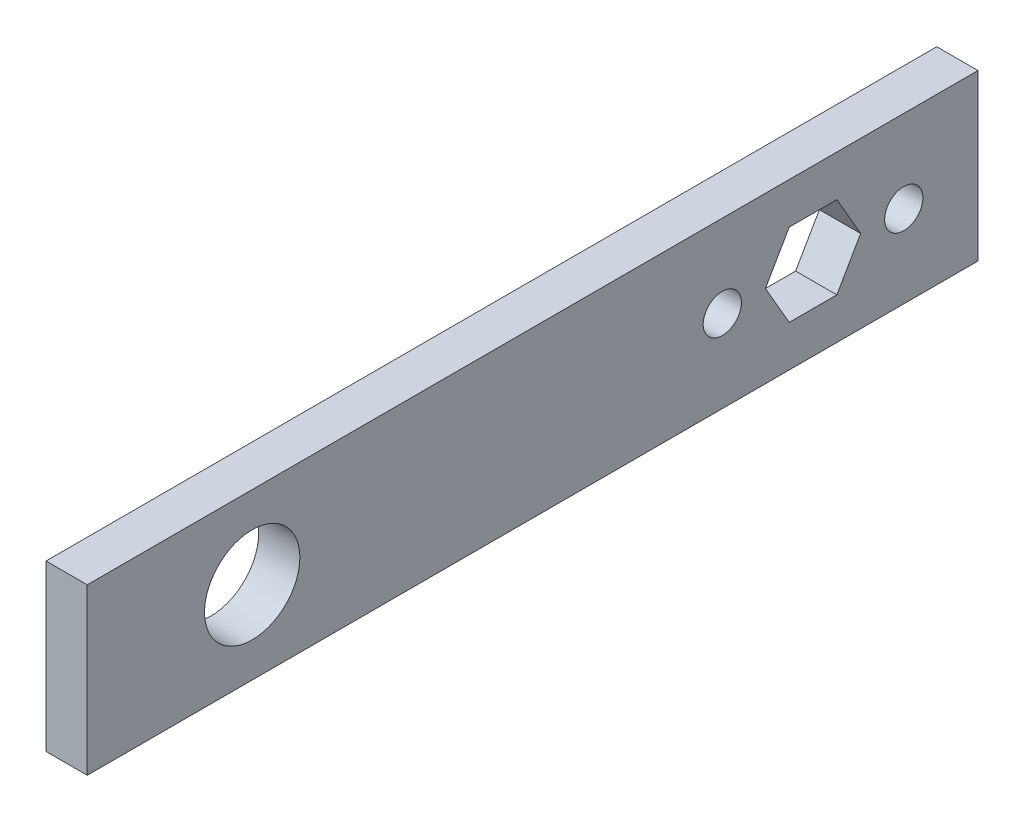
from build123d import *

# Parameters (mm, degrees)
SKETCH1_W             = 68.58
SKETCH1_H             = 12.7
SKETCH1_R             = 3.6703
BOSS_EXTRUDE1_DEPTH   = 3.175
F_4_CLEARANCE_HOLE1_D = 2.9464
CUT_EXTRUDE1_DEPTH    = 70.818242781


with BuildPart() as part:
    # Sketch1 → Boss-Extrude1 (new body)
    with BuildSketch(Plane(origin=(0, 0, 0), x_dir=(0, 0, -1), z_dir=(1, 0, 0))):
        with Locations((34.29, 6.35)):
            Rectangle(SKETCH1_W, SKETCH1_H)
        with Locations((12.7, 6.35)):
            Circle(SKETCH1_R, mode=Mode.SUBTRACT)
    extrude(amount=BOSS_EXTRUDE1_DEPTH)

    # 4 Clearance Hole1 (through all)
    with Locations(Plane(origin=(3.175, 0, 0), x_dir=(0, 0, -1), z_dir=(1, 0, 0))):
        with Locations((55.88, 6.35), (48.895, 6.35), (62.865, 6.35)):
            Hole(F_4_CLEARANCE_HOLE1_D / 2)

    # Sketch4 → Cut-Extrude1 (cut, through all)
    with BuildSketch(Plane(origin=(3.175, 0, 0), x_dir=(0, 0, -1), z_dir=(1, 0, 0))):
        Polygon((59.546174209, 6.35), (57.713087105, 9.525), (54.046912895, 9.525), (52.213825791, 6.35), (54.046912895, 3.175), (57.713087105, 3.175), align=None)
    extrude(amount=-CUT_EXTRUDE1_DEPTH, mode=Mode.SUBTRACT)


solid = part.part
